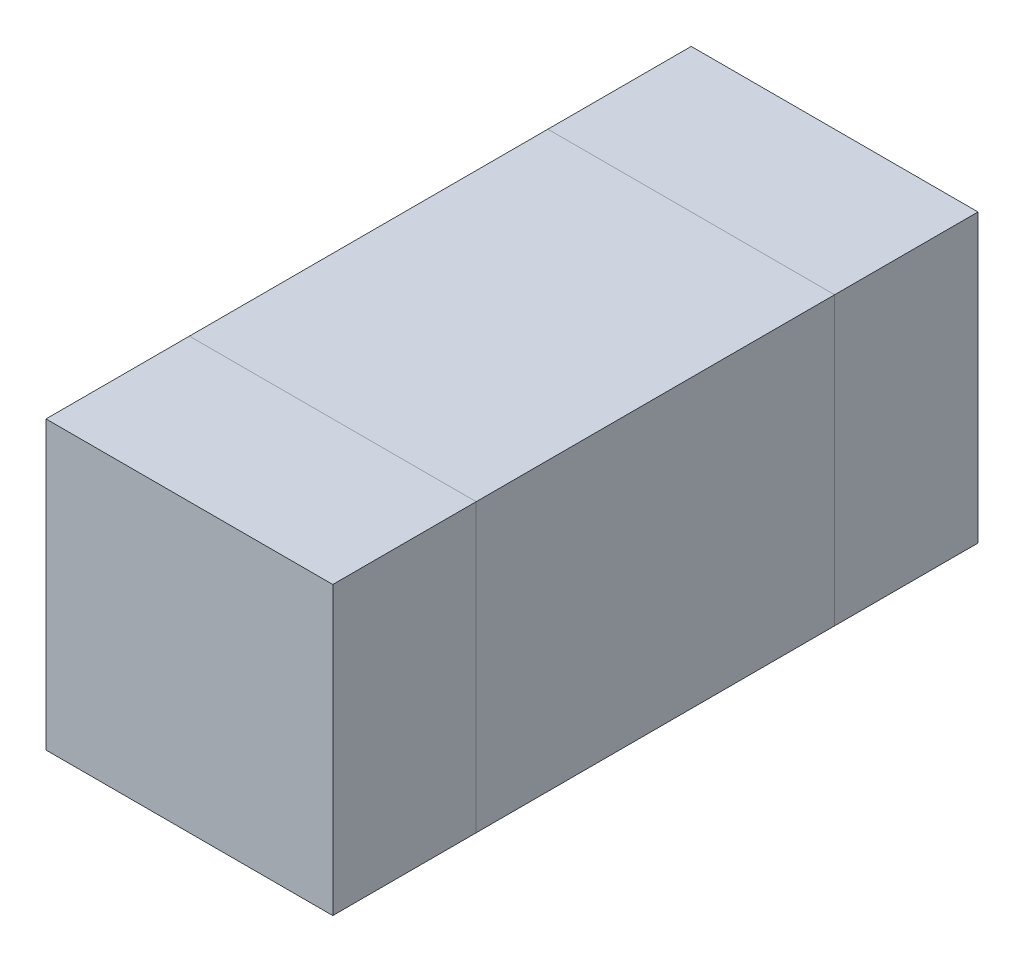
from build123d import *

# Parameters (mm, degrees)
MAINBODYS_W         = 0.8
MAINBODYS_H         = 1
MAINBODY_DEPTH      = 0.8
LEFTBODYS_W         = 0.8
LEFTBODYS_H         = 0.4
BOSS_EXTRUDE1_DEPTH = 0.8
RIGHTBODYS_W        = 0.8
RIGHTBODYS_H        = 0.4
BOSS_EXTRUDE2_DEPTH = 0.8


with BuildPart() as part:
    # MainBodyS → MainBody (new body)
    with BuildSketch(Plane(origin=(0, 0, 0), x_dir=(1, 0, 0), z_dir=(0, 1, 0))):
        Rectangle(MAINBODYS_W, MAINBODYS_H)
    extrude(amount=MAINBODY_DEPTH)


with BuildPart() as body_2:
    # LeftBodyS → Boss-Extrude1 (new body)
    with BuildSketch(Plane(origin=(0, 0, 0), x_dir=(-1, 0, 0), z_dir=(0, -1, 0))):
        with Locations((0, -0.7)):
            Rectangle(LEFTBODYS_W, LEFTBODYS_H)
    extrude(amount=-BOSS_EXTRUDE1_DEPTH)


with BuildPart() as body_3:
    # RightBodyS → Boss-Extrude2 (new body)
    with BuildSketch(Plane.XZ):
        with Locations((0, -0.7)):
            Rectangle(RIGHTBODYS_W, RIGHTBODYS_H)
    extrude(amount=-BOSS_EXTRUDE2_DEPTH)


solid = Compound([part.part, body_2.part, body_3.part])
